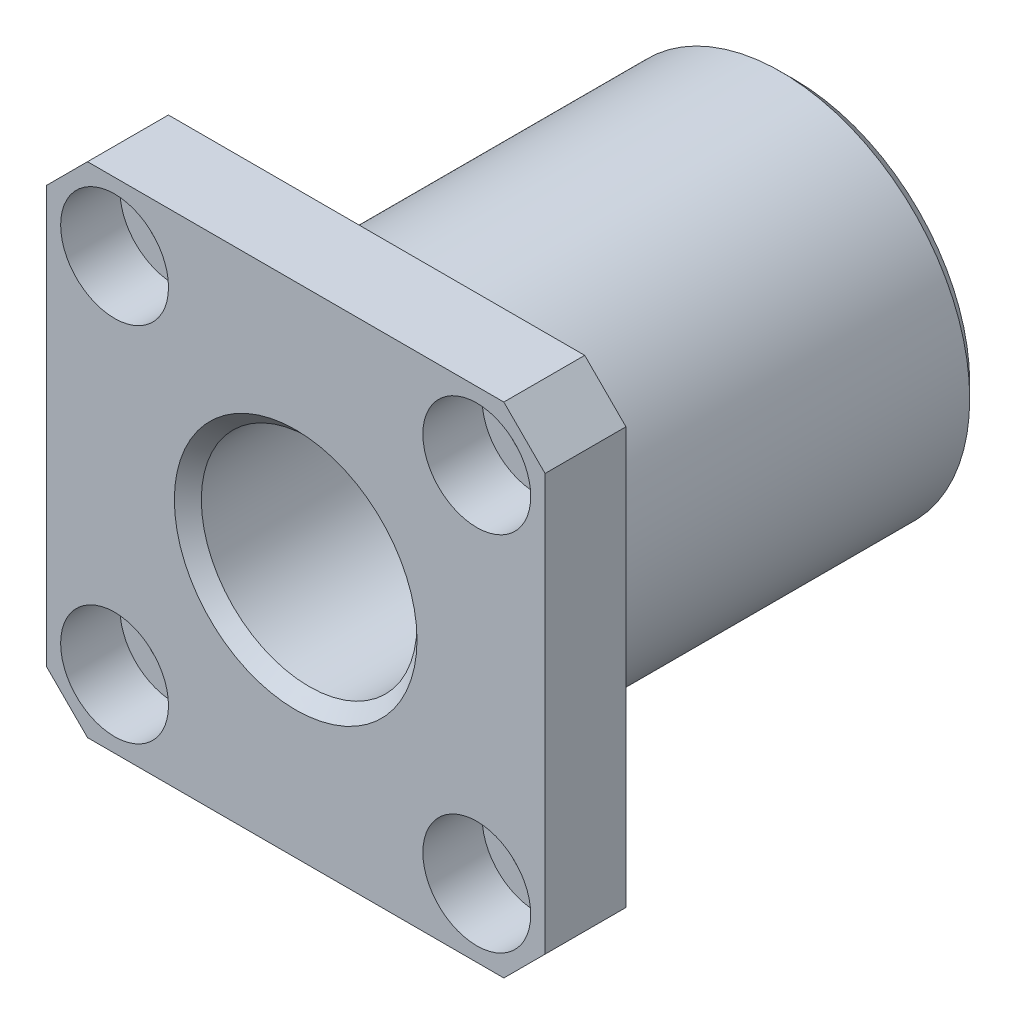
ISO-10303-21;
HEADER;
FILE_DESCRIPTION(('STEP AP214'),'2;1');
FILE_NAME('part.step','',(''),(''),'','','');
FILE_SCHEMA(('AUTOMOTIVE_DESIGN { 1 0 10303 214 1 1 1 1 }'));
ENDSEC;
DATA;
#1=APPLICATION_CONTEXT('core data for automotive mechanical design processes');
#2=APPLICATION_PROTOCOL_DEFINITION('international standard','automotive_design',2000,#1);
#3=PRODUCT_CONTEXT('',#1,'mechanical');
#4=PRODUCT('Part','Part','',(#3));
#5=PRODUCT_RELATED_PRODUCT_CATEGORY('part','',(#4));
#6=PRODUCT_DEFINITION_FORMATION('','',#4);
#7=PRODUCT_DEFINITION_CONTEXT('part definition',#1,'design');
#8=PRODUCT_DEFINITION('design','',#6,#7);
#9=PRODUCT_DEFINITION_SHAPE('','',#8);
#10=(LENGTH_UNIT() NAMED_UNIT(*) SI_UNIT(.MILLI.,.METRE.));
#11=(NAMED_UNIT(*) PLANE_ANGLE_UNIT() SI_UNIT($,.RADIAN.));
#12=(NAMED_UNIT(*) SI_UNIT($,.STERADIAN.) SOLID_ANGLE_UNIT());
#13=UNCERTAINTY_MEASURE_WITH_UNIT(LENGTH_MEASURE(1.E-05),#10,'distance_accuracy_value','');
#14=(GEOMETRIC_REPRESENTATION_CONTEXT(3) GLOBAL_UNCERTAINTY_ASSIGNED_CONTEXT((#13)) GLOBAL_UNIT_ASSIGNED_CONTEXT((#10,
#11,#12)) REPRESENTATION_CONTEXT('',''));
#15=CARTESIAN_POINT('',(0.,0.,0.));
#16=DIRECTION('',(0.,0.,1.));
#17=DIRECTION('',(1.,0.,0.));
#18=AXIS2_PLACEMENT_3D('',#15,#16,#17);
#19=CARTESIAN_POINT('',(0.,0.,36.));
#20=DIRECTION('',(0.,0.,1.));
#21=DIRECTION('',(1.,0.,0.));
#22=AXIS2_PLACEMENT_3D('',#19,#20,#21);
#23=CONICAL_SURFACE('',#22,8.,0.785398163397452);
#24=CARTESIAN_POINT('',(0.,0.,36.));
#25=DIRECTION('',(0.,0.,1.));
#26=DIRECTION('',(1.,0.,0.));
#27=AXIS2_PLACEMENT_3D('',#24,#25,#26);
#28=CIRCLE('',#27,8.);
#29=CARTESIAN_POINT('',(8.,0.,36.));
#30=VERTEX_POINT('',#29);
#31=CARTESIAN_POINT('',(-8.,0.,36.));
#32=VERTEX_POINT('',#31);
#33=EDGE_CURVE('E37',#30,#32,#28,.T.);
#34=ORIENTED_EDGE('',*,*,#33,.F.);
#35=CARTESIAN_POINT('',(0.,0.,36.));
#36=DIRECTION('',(0.,0.,1.));
#37=DIRECTION('',(1.,0.,0.));
#38=AXIS2_PLACEMENT_3D('',#35,#36,#37);
#39=CIRCLE('',#38,8.);
#40=EDGE_CURVE('E18',#32,#30,#39,.T.);
#41=ORIENTED_EDGE('',*,*,#40,.F.);
#42=DIRECTION('',(-0.70710678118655,0.,0.707106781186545));
#43=VECTOR('',#42,1.);
#44=CARTESIAN_POINT('',(-8.,0.,36.));
#45=LINE('',#44,#43);
#46=CARTESIAN_POINT('',(-9.,0.,37.));
#47=VERTEX_POINT('',#46);
#48=EDGE_CURVE('E9',#32,#47,#45,.T.);
#49=ORIENTED_EDGE('',*,*,#48,.T.);
#50=CARTESIAN_POINT('',(0.,0.,37.));
#51=DIRECTION('',(0.,0.,-1.));
#52=DIRECTION('',(1.,0.,0.));
#53=AXIS2_PLACEMENT_3D('',#50,#51,#52);
#54=CIRCLE('',#53,9.);
#55=CARTESIAN_POINT('',(9.,0.,37.));
#56=VERTEX_POINT('',#55);
#57=EDGE_CURVE('E411',#56,#47,#54,.T.);
#58=ORIENTED_EDGE('',*,*,#57,.F.);
#59=CARTESIAN_POINT('',(0.,0.,37.));
#60=DIRECTION('',(0.,0.,-1.));
#61=DIRECTION('',(1.,0.,0.));
#62=AXIS2_PLACEMENT_3D('',#59,#60,#61);
#63=CIRCLE('',#62,9.);
#64=EDGE_CURVE('E367',#47,#56,#63,.T.);
#65=ORIENTED_EDGE('',*,*,#64,.F.);
#66=ORIENTED_EDGE('',*,*,#48,.F.);
#67=EDGE_LOOP('',(#34,#41,#49,#58,#65,#66));
#68=FACE_BOUND('',#67,.T.);
#69=ADVANCED_FACE('F15',(#68),#23,.F.);
#70=CARTESIAN_POINT('',(0.,0.,1.));
#71=DIRECTION('',(0.,0.,1.));
#72=DIRECTION('',(1.,0.,0.));
#73=AXIS2_PLACEMENT_3D('',#70,#71,#72);
#74=CONICAL_SURFACE('',#73,14.,0.78539816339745);
#75=CARTESIAN_POINT('',(0.,0.,1.));
#76=DIRECTION('',(0.,0.,1.));
#77=DIRECTION('',(1.,0.,0.));
#78=AXIS2_PLACEMENT_3D('',#75,#76,#77);
#79=CIRCLE('',#78,14.);
#80=CARTESIAN_POINT('',(-14.,0.,1.));
#81=VERTEX_POINT('',#80);
#82=CARTESIAN_POINT('',(14.,0.,1.));
#83=VERTEX_POINT('',#82);
#84=EDGE_CURVE('E274',#81,#83,#79,.T.);
#85=ORIENTED_EDGE('',*,*,#84,.F.);
#86=DIRECTION('',(0.707106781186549,0.,-0.707106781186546));
#87=VECTOR('',#86,1.);
#88=CARTESIAN_POINT('',(-14.,0.,1.));
#89=LINE('',#88,#87);
#90=CARTESIAN_POINT('',(-13.,0.,0.));
#91=VERTEX_POINT('',#90);
#92=EDGE_CURVE('E24',#81,#91,#89,.T.);
#93=ORIENTED_EDGE('',*,*,#92,.T.);
#94=CARTESIAN_POINT('',(0.,0.,0.));
#95=DIRECTION('',(0.,0.,-1.));
#96=DIRECTION('',(1.,0.,0.));
#97=AXIS2_PLACEMENT_3D('',#94,#95,#96);
#98=CIRCLE('',#97,13.);
#99=CARTESIAN_POINT('',(13.,0.,0.));
#100=VERTEX_POINT('',#99);
#101=EDGE_CURVE('E277',#100,#91,#98,.T.);
#102=ORIENTED_EDGE('',*,*,#101,.F.);
#103=CARTESIAN_POINT('',(0.,0.,0.));
#104=DIRECTION('',(0.,0.,-1.));
#105=DIRECTION('',(1.,0.,0.));
#106=AXIS2_PLACEMENT_3D('',#103,#104,#105);
#107=CIRCLE('',#106,13.);
#108=EDGE_CURVE('E266',#91,#100,#107,.T.);
#109=ORIENTED_EDGE('',*,*,#108,.F.);
#110=ORIENTED_EDGE('',*,*,#92,.F.);
#111=CARTESIAN_POINT('',(0.,0.,1.));
#112=DIRECTION('',(0.,0.,1.));
#113=DIRECTION('',(1.,0.,0.));
#114=AXIS2_PLACEMENT_3D('',#111,#112,#113);
#115=CIRCLE('',#114,14.);
#116=EDGE_CURVE('E263',#83,#81,#115,.T.);
#117=ORIENTED_EDGE('',*,*,#116,.F.);
#118=EDGE_LOOP('',(#85,#93,#102,#109,#110,#117));
#119=FACE_BOUND('',#118,.T.);
#120=ADVANCED_FACE('F262',(#119),#74,.T.);
#121=CARTESIAN_POINT('',(0.,0.,0.));
#122=DIRECTION('',(0.,0.,1.));
#123=DIRECTION('',(1.,0.,0.));
#124=AXIS2_PLACEMENT_3D('',#121,#122,#123);
#125=CYLINDRICAL_SURFACE('',#124,8.);
#126=CARTESIAN_POINT('',(0.,0.,0.));
#127=DIRECTION('',(0.,0.,1.));
#128=DIRECTION('',(1.,0.,0.));
#129=AXIS2_PLACEMENT_3D('',#126,#127,#128);
#130=CIRCLE('',#129,8.);
#131=CARTESIAN_POINT('',(8.,0.,0.));
#132=VERTEX_POINT('',#131);
#133=CARTESIAN_POINT('',(-8.,0.,0.));
#134=VERTEX_POINT('',#133);
#135=EDGE_CURVE('E318',#132,#134,#130,.T.);
#136=ORIENTED_EDGE('',*,*,#135,.F.);
#137=CARTESIAN_POINT('',(0.,0.,0.));
#138=DIRECTION('',(0.,0.,1.));
#139=DIRECTION('',(1.,0.,0.));
#140=AXIS2_PLACEMENT_3D('',#137,#138,#139);
#141=CIRCLE('',#140,8.);
#142=EDGE_CURVE('E332',#134,#132,#141,.T.);
#143=ORIENTED_EDGE('',*,*,#142,.F.);
#144=DIRECTION('',(0.,0.,1.));
#145=VECTOR('',#144,1.);
#146=CARTESIAN_POINT('',(-8.,0.,0.));
#147=LINE('',#146,#145);
#148=EDGE_CURVE('E379',#134,#32,#147,.T.);
#149=ORIENTED_EDGE('',*,*,#148,.T.);
#150=ORIENTED_EDGE('',*,*,#40,.T.);
#151=ORIENTED_EDGE('',*,*,#33,.T.);
#152=ORIENTED_EDGE('',*,*,#148,.F.);
#153=EDGE_LOOP('',(#136,#143,#149,#150,#151,#152));
#154=FACE_BOUND('',#153,.T.);
#155=ADVANCED_FACE('F617',(#154),#125,.F.);
#156=CARTESIAN_POINT('',(-13.4350288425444,13.4350288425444,37.));
#157=DIRECTION('',(0.,0.,1.));
#158=DIRECTION('',(1.,0.,0.));
#159=AXIS2_PLACEMENT_3D('',#156,#157,#158);
#160=CYLINDRICAL_SURFACE('',#159,4.);
#161=CARTESIAN_POINT('',(-13.4350288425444,13.4350288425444,32.6));
#162=DIRECTION('',(0.,0.,1.));
#163=DIRECTION('',(1.,0.,0.));
#164=AXIS2_PLACEMENT_3D('',#161,#162,#163);
#165=CIRCLE('',#164,4.);
#166=CARTESIAN_POINT('',(-9.4350288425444,13.4350288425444,32.6));
#167=VERTEX_POINT('',#166);
#168=CARTESIAN_POINT('',(-17.4350288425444,13.4350288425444,32.6));
#169=VERTEX_POINT('',#168);
#170=EDGE_CURVE('E323',#167,#169,#165,.T.);
#171=ORIENTED_EDGE('',*,*,#170,.F.);
#172=CARTESIAN_POINT('',(-13.4350288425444,13.4350288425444,32.6));
#173=DIRECTION('',(0.,0.,1.));
#174=DIRECTION('',(1.,0.,0.));
#175=AXIS2_PLACEMENT_3D('',#172,#173,#174);
#176=CIRCLE('',#175,4.);
#177=EDGE_CURVE('E319',#169,#167,#176,.T.);
#178=ORIENTED_EDGE('',*,*,#177,.F.);
#179=DIRECTION('',(0.,0.,1.));
#180=VECTOR('',#179,1.);
#181=CARTESIAN_POINT('',(-17.4350288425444,13.4350288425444,37.));
#182=LINE('',#181,#180);
#183=CARTESIAN_POINT('',(-17.4350288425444,13.4350288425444,37.));
#184=VERTEX_POINT('',#183);
#185=EDGE_CURVE('E322',#169,#184,#182,.T.);
#186=ORIENTED_EDGE('',*,*,#185,.T.);
#187=CARTESIAN_POINT('',(-13.4350288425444,13.4350288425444,37.));
#188=DIRECTION('',(0.,0.,1.));
#189=DIRECTION('',(1.,0.,0.));
#190=AXIS2_PLACEMENT_3D('',#187,#188,#189);
#191=CIRCLE('',#190,4.);
#192=CARTESIAN_POINT('',(-9.4350288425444,13.4350288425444,37.));
#193=VERTEX_POINT('',#192);
#194=EDGE_CURVE('E366',#184,#193,#191,.T.);
#195=ORIENTED_EDGE('',*,*,#194,.T.);
#196=CARTESIAN_POINT('',(-13.4350288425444,13.4350288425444,37.));
#197=DIRECTION('',(0.,0.,1.));
#198=DIRECTION('',(1.,0.,0.));
#199=AXIS2_PLACEMENT_3D('',#196,#197,#198);
#200=CIRCLE('',#199,4.);
#201=EDGE_CURVE('E362',#193,#184,#200,.T.);
#202=ORIENTED_EDGE('',*,*,#201,.T.);
#203=ORIENTED_EDGE('',*,*,#185,.F.);
#204=EDGE_LOOP('',(#171,#178,#186,#195,#202,#203));
#205=FACE_BOUND('',#204,.T.);
#206=ADVANCED_FACE('F621',(#205),#160,.F.);
#207=CARTESIAN_POINT('',(-11.1850288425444,13.4350288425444,32.6));
#208=DIRECTION('',(0.,0.,-1.));
#209=DIRECTION('',(0.,-1.,0.));
#210=AXIS2_PLACEMENT_3D('',#207,#208,#209);
#211=PLANE('',#210);
#212=CARTESIAN_POINT('',(-13.4350288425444,13.4350288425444,32.6));
#213=DIRECTION('',(0.,0.,1.));
#214=DIRECTION('',(1.,0.,0.));
#215=AXIS2_PLACEMENT_3D('',#212,#213,#214);
#216=CIRCLE('',#215,2.25);
#217=CARTESIAN_POINT('',(-11.1850288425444,13.4350288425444,32.6));
#218=VERTEX_POINT('',#217);
#219=CARTESIAN_POINT('',(-15.6850288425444,13.4350288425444,32.6));
#220=VERTEX_POINT('',#219);
#221=EDGE_CURVE('E427',#218,#220,#216,.T.);
#222=ORIENTED_EDGE('',*,*,#221,.F.);
#223=CARTESIAN_POINT('',(-13.4350288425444,13.4350288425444,32.6));
#224=DIRECTION('',(0.,0.,1.));
#225=DIRECTION('',(1.,0.,0.));
#226=AXIS2_PLACEMENT_3D('',#223,#224,#225);
#227=CIRCLE('',#226,2.25);
#228=EDGE_CURVE('E491',#220,#218,#227,.T.);
#229=ORIENTED_EDGE('',*,*,#228,.F.);
#230=EDGE_LOOP('',(#222,#229));
#231=FACE_BOUND('',#230,.T.);
#232=ORIENTED_EDGE('',*,*,#170,.T.);
#233=ORIENTED_EDGE('',*,*,#177,.T.);
#234=EDGE_LOOP('',(#232,#233));
#235=FACE_BOUND('',#234,.T.);
#236=ADVANCED_FACE('F532',(#231,#235),#211,.F.);
#237=CARTESIAN_POINT('',(-13.4350288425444,13.4350288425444,37.));
#238=DIRECTION('',(0.,0.,1.));
#239=DIRECTION('',(1.,0.,0.));
#240=AXIS2_PLACEMENT_3D('',#237,#238,#239);
#241=CYLINDRICAL_SURFACE('',#240,2.25);
#242=CARTESIAN_POINT('',(-13.4350288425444,13.4350288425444,31.));
#243=DIRECTION('',(0.,0.,-1.));
#244=DIRECTION('',(-1.,0.,0.));
#245=AXIS2_PLACEMENT_3D('',#242,#243,#244);
#246=CIRCLE('',#245,2.25);
#247=CARTESIAN_POINT('',(-15.6850288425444,13.4350288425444,31.));
#248=VERTEX_POINT('',#247);
#249=EDGE_CURVE('E423',#248,#248,#246,.T.);
#250=ORIENTED_EDGE('',*,*,#249,.T.);
#251=DIRECTION('',(0.,0.,1.));
#252=VECTOR('',#251,1.);
#253=CARTESIAN_POINT('',(-15.6850288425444,13.4350288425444,37.));
#254=LINE('',#253,#252);
#255=EDGE_CURVE('E479',#248,#220,#254,.T.);
#256=ORIENTED_EDGE('',*,*,#255,.T.);
#257=ORIENTED_EDGE('',*,*,#228,.T.);
#258=ORIENTED_EDGE('',*,*,#221,.T.);
#259=ORIENTED_EDGE('',*,*,#255,.F.);
#260=EDGE_LOOP('',(#250,#256,#257,#258,#259));
#261=FACE_BOUND('',#260,.T.);
#262=ADVANCED_FACE('F530',(#261),#241,.F.);
#263=CARTESIAN_POINT('',(13.4350288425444,13.4350288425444,37.));
#264=DIRECTION('',(0.,0.,1.));
#265=DIRECTION('',(1.,0.,0.));
#266=AXIS2_PLACEMENT_3D('',#263,#264,#265);
#267=CYLINDRICAL_SURFACE('',#266,4.);
#268=CARTESIAN_POINT('',(13.4350288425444,13.4350288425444,32.6));
#269=DIRECTION('',(0.,0.,1.));
#270=DIRECTION('',(1.,0.,0.));
#271=AXIS2_PLACEMENT_3D('',#268,#269,#270);
#272=CIRCLE('',#271,4.);
#273=CARTESIAN_POINT('',(17.4350288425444,13.4350288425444,32.6));
#274=VERTEX_POINT('',#273);
#275=CARTESIAN_POINT('',(9.4350288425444,13.4350288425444,32.6));
#276=VERTEX_POINT('',#275);
#277=EDGE_CURVE('E432',#274,#276,#272,.T.);
#278=ORIENTED_EDGE('',*,*,#277,.F.);
#279=CARTESIAN_POINT('',(13.4350288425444,13.4350288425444,32.6));
#280=DIRECTION('',(0.,0.,1.));
#281=DIRECTION('',(1.,0.,0.));
#282=AXIS2_PLACEMENT_3D('',#279,#280,#281);
#283=CIRCLE('',#282,4.);
#284=EDGE_CURVE('E436',#276,#274,#283,.T.);
#285=ORIENTED_EDGE('',*,*,#284,.F.);
#286=DIRECTION('',(0.,0.,1.));
#287=VECTOR('',#286,1.);
#288=CARTESIAN_POINT('',(9.4350288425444,13.4350288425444,37.));
#289=LINE('',#288,#287);
#290=CARTESIAN_POINT('',(9.4350288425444,13.4350288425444,37.));
#291=VERTEX_POINT('',#290);
#292=EDGE_CURVE('E476',#276,#291,#289,.T.);
#293=ORIENTED_EDGE('',*,*,#292,.T.);
#294=CARTESIAN_POINT('',(13.4350288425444,13.4350288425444,37.));
#295=DIRECTION('',(0.,0.,1.));
#296=DIRECTION('',(1.,0.,0.));
#297=AXIS2_PLACEMENT_3D('',#294,#295,#296);
#298=CIRCLE('',#297,4.);
#299=CARTESIAN_POINT('',(17.4350288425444,13.4350288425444,37.));
#300=VERTEX_POINT('',#299);
#301=EDGE_CURVE('E297',#291,#300,#298,.T.);
#302=ORIENTED_EDGE('',*,*,#301,.T.);
#303=CARTESIAN_POINT('',(13.4350288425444,13.4350288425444,37.));
#304=DIRECTION('',(0.,0.,1.));
#305=DIRECTION('',(1.,0.,0.));
#306=AXIS2_PLACEMENT_3D('',#303,#304,#305);
#307=CIRCLE('',#306,4.);
#308=EDGE_CURVE('E472',#300,#291,#307,.T.);
#309=ORIENTED_EDGE('',*,*,#308,.T.);
#310=ORIENTED_EDGE('',*,*,#292,.F.);
#311=EDGE_LOOP('',(#278,#285,#293,#302,#309,#310));
#312=FACE_BOUND('',#311,.T.);
#313=ADVANCED_FACE('F630',(#312),#267,.F.);
#314=CARTESIAN_POINT('',(15.6850288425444,13.4350288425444,32.6));
#315=DIRECTION('',(0.,0.,-1.));
#316=DIRECTION('',(0.,-1.,0.));
#317=AXIS2_PLACEMENT_3D('',#314,#315,#316);
#318=PLANE('',#317);
#319=CARTESIAN_POINT('',(13.4350288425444,13.4350288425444,32.6));
#320=DIRECTION('',(0.,0.,1.));
#321=DIRECTION('',(1.,0.,0.));
#322=AXIS2_PLACEMENT_3D('',#319,#320,#321);
#323=CIRCLE('',#322,2.25);
#324=CARTESIAN_POINT('',(15.6850288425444,13.4350288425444,32.6));
#325=VERTEX_POINT('',#324);
#326=CARTESIAN_POINT('',(11.1850288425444,13.4350288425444,32.6));
#327=VERTEX_POINT('',#326);
#328=EDGE_CURVE('E437',#325,#327,#323,.T.);
#329=ORIENTED_EDGE('',*,*,#328,.F.);
#330=CARTESIAN_POINT('',(13.4350288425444,13.4350288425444,32.6));
#331=DIRECTION('',(0.,0.,1.));
#332=DIRECTION('',(1.,0.,0.));
#333=AXIS2_PLACEMENT_3D('',#330,#331,#332);
#334=CIRCLE('',#333,2.25);
#335=EDGE_CURVE('E447',#327,#325,#334,.T.);
#336=ORIENTED_EDGE('',*,*,#335,.F.);
#337=EDGE_LOOP('',(#329,#336));
#338=FACE_BOUND('',#337,.T.);
#339=ORIENTED_EDGE('',*,*,#277,.T.);
#340=ORIENTED_EDGE('',*,*,#284,.T.);
#341=EDGE_LOOP('',(#339,#340));
#342=FACE_BOUND('',#341,.T.);
#343=ADVANCED_FACE('F633',(#338,#342),#318,.F.);
#344=CARTESIAN_POINT('',(13.4350288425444,13.4350288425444,37.));
#345=DIRECTION('',(0.,0.,1.));
#346=DIRECTION('',(1.,0.,0.));
#347=AXIS2_PLACEMENT_3D('',#344,#345,#346);
#348=CYLINDRICAL_SURFACE('',#347,2.25);
#349=CARTESIAN_POINT('',(13.4350288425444,13.4350288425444,31.));
#350=DIRECTION('',(0.,0.,-1.));
#351=DIRECTION('',(-1.,0.,0.));
#352=AXIS2_PLACEMENT_3D('',#349,#350,#351);
#353=CIRCLE('',#352,2.25);
#354=CARTESIAN_POINT('',(11.1850288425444,13.4350288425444,31.));
#355=VERTEX_POINT('',#354);
#356=EDGE_CURVE('E431',#355,#355,#353,.T.);
#357=ORIENTED_EDGE('',*,*,#356,.T.);
#358=DIRECTION('',(0.,0.,1.));
#359=VECTOR('',#358,1.);
#360=CARTESIAN_POINT('',(11.1850288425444,13.4350288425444,37.));
#361=LINE('',#360,#359);
#362=EDGE_CURVE('E514',#355,#327,#361,.T.);
#363=ORIENTED_EDGE('',*,*,#362,.T.);
#364=ORIENTED_EDGE('',*,*,#335,.T.);
#365=ORIENTED_EDGE('',*,*,#328,.T.);
#366=ORIENTED_EDGE('',*,*,#362,.F.);
#367=EDGE_LOOP('',(#357,#363,#364,#365,#366));
#368=FACE_BOUND('',#367,.T.);
#369=ADVANCED_FACE('F637',(#368),#348,.F.);
#370=CARTESIAN_POINT('',(13.4350288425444,-13.4350288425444,37.));
#371=DIRECTION('',(0.,0.,1.));
#372=DIRECTION('',(1.,0.,0.));
#373=AXIS2_PLACEMENT_3D('',#370,#371,#372);
#374=CYLINDRICAL_SURFACE('',#373,4.);
#375=CARTESIAN_POINT('',(13.4350288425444,-13.4350288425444,32.6));
#376=DIRECTION('',(0.,0.,1.));
#377=DIRECTION('',(1.,0.,0.));
#378=AXIS2_PLACEMENT_3D('',#375,#376,#377);
#379=CIRCLE('',#378,4.);
#380=CARTESIAN_POINT('',(17.4350288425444,-13.4350288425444,32.6));
#381=VERTEX_POINT('',#380);
#382=CARTESIAN_POINT('',(9.4350288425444,-13.4350288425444,32.6));
#383=VERTEX_POINT('',#382);
#384=EDGE_CURVE('E380',#381,#383,#379,.T.);
#385=ORIENTED_EDGE('',*,*,#384,.F.);
#386=CARTESIAN_POINT('',(13.4350288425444,-13.4350288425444,32.6));
#387=DIRECTION('',(0.,0.,1.));
#388=DIRECTION('',(1.,0.,0.));
#389=AXIS2_PLACEMENT_3D('',#386,#387,#388);
#390=CIRCLE('',#389,4.);
#391=EDGE_CURVE('E384',#383,#381,#390,.T.);
#392=ORIENTED_EDGE('',*,*,#391,.F.);
#393=DIRECTION('',(0.,0.,1.));
#394=VECTOR('',#393,1.);
#395=CARTESIAN_POINT('',(9.4350288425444,-13.4350288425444,37.));
#396=LINE('',#395,#394);
#397=CARTESIAN_POINT('',(9.4350288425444,-13.4350288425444,37.));
#398=VERTEX_POINT('',#397);
#399=EDGE_CURVE('E511',#383,#398,#396,.T.);
#400=ORIENTED_EDGE('',*,*,#399,.T.);
#401=CARTESIAN_POINT('',(13.4350288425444,-13.4350288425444,37.));
#402=DIRECTION('',(0.,0.,1.));
#403=DIRECTION('',(1.,0.,0.));
#404=AXIS2_PLACEMENT_3D('',#401,#402,#403);
#405=CIRCLE('',#404,4.);
#406=CARTESIAN_POINT('',(17.4350288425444,-13.4350288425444,37.));
#407=VERTEX_POINT('',#406);
#408=EDGE_CURVE('E296',#398,#407,#405,.T.);
#409=ORIENTED_EDGE('',*,*,#408,.T.);
#410=CARTESIAN_POINT('',(13.4350288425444,-13.4350288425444,37.));
#411=DIRECTION('',(0.,0.,1.));
#412=DIRECTION('',(1.,0.,0.));
#413=AXIS2_PLACEMENT_3D('',#410,#411,#412);
#414=CIRCLE('',#413,4.);
#415=EDGE_CURVE('E292',#407,#398,#414,.T.);
#416=ORIENTED_EDGE('',*,*,#415,.T.);
#417=ORIENTED_EDGE('',*,*,#399,.F.);
#418=EDGE_LOOP('',(#385,#392,#400,#409,#416,#417));
#419=FACE_BOUND('',#418,.T.);
#420=ADVANCED_FACE('F568',(#419),#374,.F.);
#421=CARTESIAN_POINT('',(15.6850288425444,-13.4350288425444,32.6));
#422=DIRECTION('',(0.,0.,-1.));
#423=DIRECTION('',(0.,-1.,0.));
#424=AXIS2_PLACEMENT_3D('',#421,#422,#423);
#425=PLANE('',#424);
#426=CARTESIAN_POINT('',(13.4350288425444,-13.4350288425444,32.6));
#427=DIRECTION('',(0.,0.,1.));
#428=DIRECTION('',(1.,0.,0.));
#429=AXIS2_PLACEMENT_3D('',#426,#427,#428);
#430=CIRCLE('',#429,2.25);
#431=CARTESIAN_POINT('',(15.6850288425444,-13.4350288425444,32.6));
#432=VERTEX_POINT('',#431);
#433=CARTESIAN_POINT('',(11.1850288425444,-13.4350288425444,32.6));
#434=VERTEX_POINT('',#433);
#435=EDGE_CURVE('E385',#432,#434,#430,.T.);
#436=ORIENTED_EDGE('',*,*,#435,.F.);
#437=CARTESIAN_POINT('',(13.4350288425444,-13.4350288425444,32.6));
#438=DIRECTION('',(0.,0.,1.));
#439=DIRECTION('',(1.,0.,0.));
#440=AXIS2_PLACEMENT_3D('',#437,#438,#439);
#441=CIRCLE('',#440,2.25);
#442=EDGE_CURVE('E505',#434,#432,#441,.T.);
#443=ORIENTED_EDGE('',*,*,#442,.F.);
#444=EDGE_LOOP('',(#436,#443));
#445=FACE_BOUND('',#444,.T.);
#446=ORIENTED_EDGE('',*,*,#384,.T.);
#447=ORIENTED_EDGE('',*,*,#391,.T.);
#448=EDGE_LOOP('',(#446,#447));
#449=FACE_BOUND('',#448,.T.);
#450=ADVANCED_FACE('F566',(#445,#449),#425,.F.);
#451=CARTESIAN_POINT('',(13.4350288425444,-13.4350288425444,37.));
#452=DIRECTION('',(0.,0.,1.));
#453=DIRECTION('',(1.,0.,0.));
#454=AXIS2_PLACEMENT_3D('',#451,#452,#453);
#455=CYLINDRICAL_SURFACE('',#454,2.25);
#456=CARTESIAN_POINT('',(13.4350288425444,-13.4350288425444,31.));
#457=DIRECTION('',(0.,0.,-1.));
#458=DIRECTION('',(-1.,0.,0.));
#459=AXIS2_PLACEMENT_3D('',#456,#457,#458);
#460=CIRCLE('',#459,2.25);
#461=CARTESIAN_POINT('',(11.1850288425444,-13.4350288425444,31.));
#462=VERTEX_POINT('',#461);
#463=EDGE_CURVE('E441',#462,#462,#460,.T.);
#464=ORIENTED_EDGE('',*,*,#463,.T.);
#465=DIRECTION('',(0.,0.,1.));
#466=VECTOR('',#465,1.);
#467=CARTESIAN_POINT('',(11.1850288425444,-13.4350288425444,37.));
#468=LINE('',#467,#466);
#469=EDGE_CURVE('E290',#462,#434,#468,.T.);
#470=ORIENTED_EDGE('',*,*,#469,.T.);
#471=ORIENTED_EDGE('',*,*,#442,.T.);
#472=ORIENTED_EDGE('',*,*,#435,.T.);
#473=ORIENTED_EDGE('',*,*,#469,.F.);
#474=EDGE_LOOP('',(#464,#470,#471,#472,#473));
#475=FACE_BOUND('',#474,.T.);
#476=ADVANCED_FACE('F646',(#475),#455,.F.);
#477=CARTESIAN_POINT('',(-13.4350288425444,-13.4350288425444,37.));
#478=DIRECTION('',(0.,0.,1.));
#479=DIRECTION('',(1.,0.,0.));
#480=AXIS2_PLACEMENT_3D('',#477,#478,#479);
#481=CYLINDRICAL_SURFACE('',#480,4.);
#482=CARTESIAN_POINT('',(-13.4350288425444,-13.4350288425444,32.6));
#483=DIRECTION('',(0.,0.,1.));
#484=DIRECTION('',(1.,0.,0.));
#485=AXIS2_PLACEMENT_3D('',#482,#483,#484);
#486=CIRCLE('',#485,4.);
#487=CARTESIAN_POINT('',(-9.4350288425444,-13.4350288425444,32.6));
#488=VERTEX_POINT('',#487);
#489=CARTESIAN_POINT('',(-17.4350288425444,-13.4350288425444,32.6));
#490=VERTEX_POINT('',#489);
#491=EDGE_CURVE('E328',#488,#490,#486,.T.);
#492=ORIENTED_EDGE('',*,*,#491,.F.);
#493=CARTESIAN_POINT('',(-13.4350288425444,-13.4350288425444,32.6));
#494=DIRECTION('',(0.,0.,1.));
#495=DIRECTION('',(1.,0.,0.));
#496=AXIS2_PLACEMENT_3D('',#493,#494,#495);
#497=CIRCLE('',#496,4.);
#498=EDGE_CURVE('E324',#490,#488,#497,.T.);
#499=ORIENTED_EDGE('',*,*,#498,.F.);
#500=DIRECTION('',(0.,0.,1.));
#501=VECTOR('',#500,1.);
#502=CARTESIAN_POINT('',(-17.4350288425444,-13.4350288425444,37.));
#503=LINE('',#502,#501);
#504=CARTESIAN_POINT('',(-17.4350288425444,-13.4350288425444,37.));
#505=VERTEX_POINT('',#504);
#506=EDGE_CURVE('E327',#490,#505,#503,.T.);
#507=ORIENTED_EDGE('',*,*,#506,.T.);
#508=CARTESIAN_POINT('',(-13.4350288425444,-13.4350288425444,37.));
#509=DIRECTION('',(0.,0.,1.));
#510=DIRECTION('',(1.,0.,0.));
#511=AXIS2_PLACEMENT_3D('',#508,#509,#510);
#512=CIRCLE('',#511,4.);
#513=CARTESIAN_POINT('',(-9.4350288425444,-13.4350288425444,37.));
#514=VERTEX_POINT('',#513);
#515=EDGE_CURVE('E488',#505,#514,#512,.T.);
#516=ORIENTED_EDGE('',*,*,#515,.T.);
#517=CARTESIAN_POINT('',(-13.4350288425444,-13.4350288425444,37.));
#518=DIRECTION('',(0.,0.,1.));
#519=DIRECTION('',(1.,0.,0.));
#520=AXIS2_PLACEMENT_3D('',#517,#518,#519);
#521=CIRCLE('',#520,4.);
#522=EDGE_CURVE('E484',#514,#505,#521,.T.);
#523=ORIENTED_EDGE('',*,*,#522,.T.);
#524=ORIENTED_EDGE('',*,*,#506,.F.);
#525=EDGE_LOOP('',(#492,#499,#507,#516,#523,#524));
#526=FACE_BOUND('',#525,.T.);
#527=ADVANCED_FACE('F648',(#526),#481,.F.);
#528=CARTESIAN_POINT('',(-11.1850288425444,-13.4350288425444,32.6));
#529=DIRECTION('',(0.,0.,-1.));
#530=DIRECTION('',(0.,-1.,0.));
#531=AXIS2_PLACEMENT_3D('',#528,#529,#530);
#532=PLANE('',#531);
#533=CARTESIAN_POINT('',(-13.4350288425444,-13.4350288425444,32.6));
#534=DIRECTION('',(0.,0.,1.));
#535=DIRECTION('',(1.,0.,0.));
#536=AXIS2_PLACEMENT_3D('',#533,#534,#535);
#537=CIRCLE('',#536,2.25);
#538=CARTESIAN_POINT('',(-11.1850288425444,-13.4350288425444,32.6));
#539=VERTEX_POINT('',#538);
#540=CARTESIAN_POINT('',(-15.6850288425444,-13.4350288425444,32.6));
#541=VERTEX_POINT('',#540);
#542=EDGE_CURVE('E466',#539,#541,#537,.T.);
#543=ORIENTED_EDGE('',*,*,#542,.F.);
#544=CARTESIAN_POINT('',(-13.4350288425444,-13.4350288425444,32.6));
#545=DIRECTION('',(0.,0.,1.));
#546=DIRECTION('',(1.,0.,0.));
#547=AXIS2_PLACEMENT_3D('',#544,#545,#546);
#548=CIRCLE('',#547,2.25);
#549=EDGE_CURVE('E462',#541,#539,#548,.T.);
#550=ORIENTED_EDGE('',*,*,#549,.F.);
#551=EDGE_LOOP('',(#543,#550));
#552=FACE_BOUND('',#551,.T.);
#553=ORIENTED_EDGE('',*,*,#491,.T.);
#554=ORIENTED_EDGE('',*,*,#498,.T.);
#555=EDGE_LOOP('',(#553,#554));
#556=FACE_BOUND('',#555,.T.);
#557=ADVANCED_FACE('F651',(#552,#556),#532,.F.);
#558=CARTESIAN_POINT('',(-13.4350288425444,-13.4350288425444,37.));
#559=DIRECTION('',(0.,0.,1.));
#560=DIRECTION('',(1.,0.,0.));
#561=AXIS2_PLACEMENT_3D('',#558,#559,#560);
#562=CYLINDRICAL_SURFACE('',#561,2.25);
#563=CARTESIAN_POINT('',(-13.4350288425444,-13.4350288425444,31.));
#564=DIRECTION('',(0.,0.,-1.));
#565=DIRECTION('',(-1.,0.,0.));
#566=AXIS2_PLACEMENT_3D('',#563,#564,#565);
#567=CIRCLE('',#566,2.25);
#568=CARTESIAN_POINT('',(-15.6850288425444,-13.4350288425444,31.));
#569=VERTEX_POINT('',#568);
#570=EDGE_CURVE('E451',#569,#569,#567,.T.);
#571=ORIENTED_EDGE('',*,*,#570,.T.);
#572=DIRECTION('',(0.,0.,1.));
#573=VECTOR('',#572,1.);
#574=CARTESIAN_POINT('',(-15.6850288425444,-13.4350288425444,37.));
#575=LINE('',#574,#573);
#576=EDGE_CURVE('E467',#569,#541,#575,.T.);
#577=ORIENTED_EDGE('',*,*,#576,.T.);
#578=ORIENTED_EDGE('',*,*,#549,.T.);
#579=ORIENTED_EDGE('',*,*,#542,.T.);
#580=ORIENTED_EDGE('',*,*,#576,.F.);
#581=EDGE_LOOP('',(#571,#577,#578,#579,#580));
#582=FACE_BOUND('',#581,.T.);
#583=ADVANCED_FACE('F653',(#582),#562,.F.);
#584=CARTESIAN_POINT('',(-18.5,-15.4411254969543,0.));
#585=DIRECTION('',(0.707106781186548,0.707106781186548,0.));
#586=DIRECTION('',(0.,0.,-1.));
#587=AXIS2_PLACEMENT_3D('',#584,#585,#586);
#588=PLANE('',#587);
#589=DIRECTION('',(0.707106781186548,-0.707106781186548,0.));
#590=VECTOR('',#589,1.);
#591=CARTESIAN_POINT('',(-18.5,-15.4411254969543,31.));
#592=LINE('',#591,#590);
#593=CARTESIAN_POINT('',(-18.5,-15.4411254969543,31.));
#594=VERTEX_POINT('',#593);
#595=CARTESIAN_POINT('',(-15.4411254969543,-18.5,31.));
#596=VERTEX_POINT('',#595);
#597=EDGE_CURVE('E407',#594,#596,#592,.T.);
#598=ORIENTED_EDGE('',*,*,#597,.T.);
#599=DIRECTION('',(0.,0.,1.));
#600=VECTOR('',#599,1.);
#601=CARTESIAN_POINT('',(-15.4411254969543,-18.5,31.));
#602=LINE('',#601,#600);
#603=CARTESIAN_POINT('',(-15.4411254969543,-18.5,37.));
#604=VERTEX_POINT('',#603);
#605=EDGE_CURVE('E345',#596,#604,#602,.T.);
#606=ORIENTED_EDGE('',*,*,#605,.T.);
#607=DIRECTION('',(-0.707106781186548,0.707106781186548,0.));
#608=VECTOR('',#607,1.);
#609=CARTESIAN_POINT('',(-15.4411254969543,-18.5,37.));
#610=LINE('',#609,#608);
#611=CARTESIAN_POINT('',(-18.5,-15.4411254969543,37.));
#612=VERTEX_POINT('',#611);
#613=EDGE_CURVE('E311',#604,#612,#610,.T.);
#614=ORIENTED_EDGE('',*,*,#613,.T.);
#615=DIRECTION('',(0.,0.,1.));
#616=VECTOR('',#615,1.);
#617=CARTESIAN_POINT('',(-18.5,-15.4411254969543,31.));
#618=LINE('',#617,#616);
#619=EDGE_CURVE('E361',#594,#612,#618,.T.);
#620=ORIENTED_EDGE('',*,*,#619,.F.);
#621=EDGE_LOOP('',(#598,#606,#614,#620));
#622=FACE_BOUND('',#621,.T.);
#623=ADVANCED_FACE('F555',(#622),#588,.F.);
#624=CARTESIAN_POINT('',(18.5,-15.4411254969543,0.));
#625=DIRECTION('',(-0.707106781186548,0.707106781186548,0.));
#626=DIRECTION('',(0.,0.,1.));
#627=AXIS2_PLACEMENT_3D('',#624,#625,#626);
#628=PLANE('',#627);
#629=DIRECTION('',(0.707106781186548,0.707106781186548,0.));
#630=VECTOR('',#629,1.);
#631=CARTESIAN_POINT('',(15.4411254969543,-18.5,31.));
#632=LINE('',#631,#630);
#633=CARTESIAN_POINT('',(15.4411254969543,-18.5,31.));
#634=VERTEX_POINT('',#633);
#635=CARTESIAN_POINT('',(18.5,-15.4411254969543,31.));
#636=VERTEX_POINT('',#635);
#637=EDGE_CURVE('E420',#634,#636,#632,.T.);
#638=ORIENTED_EDGE('',*,*,#637,.T.);
#639=DIRECTION('',(0.,0.,1.));
#640=VECTOR('',#639,1.);
#641=CARTESIAN_POINT('',(18.5,-15.4411254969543,31.));
#642=LINE('',#641,#640);
#643=CARTESIAN_POINT('',(18.5,-15.4411254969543,37.));
#644=VERTEX_POINT('',#643);
#645=EDGE_CURVE('E335',#636,#644,#642,.T.);
#646=ORIENTED_EDGE('',*,*,#645,.T.);
#647=DIRECTION('',(-0.707106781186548,-0.707106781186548,0.));
#648=VECTOR('',#647,1.);
#649=CARTESIAN_POINT('',(18.5,-15.4411254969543,37.));
#650=LINE('',#649,#648);
#651=CARTESIAN_POINT('',(15.4411254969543,-18.5,37.));
#652=VERTEX_POINT('',#651);
#653=EDGE_CURVE('E307',#644,#652,#650,.T.);
#654=ORIENTED_EDGE('',*,*,#653,.T.);
#655=DIRECTION('',(0.,0.,1.));
#656=VECTOR('',#655,1.);
#657=CARTESIAN_POINT('',(15.4411254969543,-18.5,31.));
#658=LINE('',#657,#656);
#659=EDGE_CURVE('E346',#634,#652,#658,.T.);
#660=ORIENTED_EDGE('',*,*,#659,.F.);
#661=EDGE_LOOP('',(#638,#646,#654,#660));
#662=FACE_BOUND('',#661,.T.);
#663=ADVANCED_FACE('F590',(#662),#628,.F.);
#664=CARTESIAN_POINT('',(18.5,15.4411254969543,0.));
#665=DIRECTION('',(-0.707106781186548,-0.707106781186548,0.));
#666=DIRECTION('',(-0.707106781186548,0.707106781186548,0.));
#667=AXIS2_PLACEMENT_3D('',#664,#665,#666);
#668=PLANE('',#667);
#669=DIRECTION('',(-0.707106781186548,0.707106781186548,0.));
#670=VECTOR('',#669,1.);
#671=CARTESIAN_POINT('',(18.5,15.4411254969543,31.));
#672=LINE('',#671,#670);
#673=CARTESIAN_POINT('',(18.5,15.4411254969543,31.));
#674=VERTEX_POINT('',#673);
#675=CARTESIAN_POINT('',(15.4411254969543,18.5,31.));
#676=VERTEX_POINT('',#675);
#677=EDGE_CURVE('E417',#674,#676,#672,.T.);
#678=ORIENTED_EDGE('',*,*,#677,.T.);
#679=DIRECTION('',(0.,0.,1.));
#680=VECTOR('',#679,1.);
#681=CARTESIAN_POINT('',(15.4411254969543,18.5,31.));
#682=LINE('',#681,#680);
#683=CARTESIAN_POINT('',(15.4411254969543,18.5,37.));
#684=VERTEX_POINT('',#683);
#685=EDGE_CURVE('E389',#676,#684,#682,.T.);
#686=ORIENTED_EDGE('',*,*,#685,.T.);
#687=DIRECTION('',(0.707106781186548,-0.707106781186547,0.));
#688=VECTOR('',#687,1.);
#689=CARTESIAN_POINT('',(15.4411254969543,18.5,37.));
#690=LINE('',#689,#688);
#691=CARTESIAN_POINT('',(18.5,15.4411254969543,37.));
#692=VERTEX_POINT('',#691);
#693=EDGE_CURVE('E310',#684,#692,#690,.T.);
#694=ORIENTED_EDGE('',*,*,#693,.T.);
#695=DIRECTION('',(0.,0.,1.));
#696=VECTOR('',#695,1.);
#697=CARTESIAN_POINT('',(18.5,15.4411254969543,31.));
#698=LINE('',#697,#696);
#699=EDGE_CURVE('E298',#674,#692,#698,.T.);
#700=ORIENTED_EDGE('',*,*,#699,.F.);
#701=EDGE_LOOP('',(#678,#686,#694,#700));
#702=FACE_BOUND('',#701,.T.);
#703=ADVANCED_FACE('F598',(#702),#668,.F.);
#704=CARTESIAN_POINT('',(-18.5,15.4411254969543,0.));
#705=DIRECTION('',(0.707106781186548,-0.707106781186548,0.));
#706=DIRECTION('',(0.,0.,-1.));
#707=AXIS2_PLACEMENT_3D('',#704,#705,#706);
#708=PLANE('',#707);
#709=DIRECTION('',(-0.707106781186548,-0.707106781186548,0.));
#710=VECTOR('',#709,1.);
#711=CARTESIAN_POINT('',(-15.4411254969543,18.5,31.));
#712=LINE('',#711,#710);
#713=CARTESIAN_POINT('',(-15.4411254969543,18.5,31.));
#714=VERTEX_POINT('',#713);
#715=CARTESIAN_POINT('',(-18.5,15.4411254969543,31.));
#716=VERTEX_POINT('',#715);
#717=EDGE_CURVE('E414',#714,#716,#712,.T.);
#718=ORIENTED_EDGE('',*,*,#717,.T.);
#719=DIRECTION('',(0.,0.,1.));
#720=VECTOR('',#719,1.);
#721=CARTESIAN_POINT('',(-18.5,15.4411254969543,31.));
#722=LINE('',#721,#720);
#723=CARTESIAN_POINT('',(-18.5,15.4411254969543,37.));
#724=VERTEX_POINT('',#723);
#725=EDGE_CURVE('E372',#716,#724,#722,.T.);
#726=ORIENTED_EDGE('',*,*,#725,.T.);
#727=DIRECTION('',(0.707106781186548,0.707106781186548,0.));
#728=VECTOR('',#727,1.);
#729=CARTESIAN_POINT('',(-18.5,15.4411254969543,37.));
#730=LINE('',#729,#728);
#731=CARTESIAN_POINT('',(-15.4411254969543,18.5,37.));
#732=VERTEX_POINT('',#731);
#733=EDGE_CURVE('E408',#724,#732,#730,.T.);
#734=ORIENTED_EDGE('',*,*,#733,.T.);
#735=DIRECTION('',(0.,0.,1.));
#736=VECTOR('',#735,1.);
#737=CARTESIAN_POINT('',(-15.4411254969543,18.5,31.));
#738=LINE('',#737,#736);
#739=EDGE_CURVE('E397',#714,#732,#738,.T.);
#740=ORIENTED_EDGE('',*,*,#739,.F.);
#741=EDGE_LOOP('',(#718,#726,#734,#740));
#742=FACE_BOUND('',#741,.T.);
#743=ADVANCED_FACE('F574',(#742),#708,.F.);
#744=CARTESIAN_POINT('',(0.,0.,37.));
#745=DIRECTION('',(0.,0.,1.));
#746=DIRECTION('',(1.,0.,0.));
#747=AXIS2_PLACEMENT_3D('',#744,#745,#746);
#748=PLANE('',#747);
#749=ORIENTED_EDGE('',*,*,#522,.F.);
#750=ORIENTED_EDGE('',*,*,#515,.F.);
#751=EDGE_LOOP('',(#749,#750));
#752=FACE_BOUND('',#751,.T.);
#753=ORIENTED_EDGE('',*,*,#415,.F.);
#754=ORIENTED_EDGE('',*,*,#408,.F.);
#755=EDGE_LOOP('',(#753,#754));
#756=FACE_BOUND('',#755,.T.);
#757=ORIENTED_EDGE('',*,*,#308,.F.);
#758=ORIENTED_EDGE('',*,*,#301,.F.);
#759=EDGE_LOOP('',(#757,#758));
#760=FACE_BOUND('',#759,.T.);
#761=ORIENTED_EDGE('',*,*,#201,.F.);
#762=ORIENTED_EDGE('',*,*,#194,.F.);
#763=EDGE_LOOP('',(#761,#762));
#764=FACE_BOUND('',#763,.T.);
#765=ORIENTED_EDGE('',*,*,#57,.T.);
#766=ORIENTED_EDGE('',*,*,#64,.T.);
#767=EDGE_LOOP('',(#765,#766));
#768=FACE_BOUND('',#767,.T.);
#769=ORIENTED_EDGE('',*,*,#613,.F.);
#770=DIRECTION('',(1.,0.,0.));
#771=VECTOR('',#770,1.);
#772=CARTESIAN_POINT('',(-15.4411254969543,-18.5,37.));
#773=LINE('',#772,#771);
#774=EDGE_CURVE('E349',#604,#652,#773,.T.);
#775=ORIENTED_EDGE('',*,*,#774,.T.);
#776=ORIENTED_EDGE('',*,*,#653,.F.);
#777=DIRECTION('',(0.,1.,0.));
#778=VECTOR('',#777,1.);
#779=CARTESIAN_POINT('',(18.5,-15.4411254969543,37.));
#780=LINE('',#779,#778);
#781=EDGE_CURVE('E301',#644,#692,#780,.T.);
#782=ORIENTED_EDGE('',*,*,#781,.T.);
#783=ORIENTED_EDGE('',*,*,#693,.F.);
#784=DIRECTION('',(-1.,0.,0.));
#785=VECTOR('',#784,1.);
#786=CARTESIAN_POINT('',(15.4411254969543,18.5,37.));
#787=LINE('',#786,#785);
#788=EDGE_CURVE('E401',#684,#732,#787,.T.);
#789=ORIENTED_EDGE('',*,*,#788,.T.);
#790=ORIENTED_EDGE('',*,*,#733,.F.);
#791=DIRECTION('',(0.,-1.,0.));
#792=VECTOR('',#791,1.);
#793=CARTESIAN_POINT('',(-18.5,15.4411254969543,37.));
#794=LINE('',#793,#792);
#795=EDGE_CURVE('E368',#724,#612,#794,.T.);
#796=ORIENTED_EDGE('',*,*,#795,.T.);
#797=EDGE_LOOP('',(#769,#775,#776,#782,#783,#789,#790,#796));
#798=FACE_BOUND('',#797,.T.);
#799=ADVANCED_FACE('F540',(#752,#756,#760,#764,#768,#798),#748,.T.);
#800=CARTESIAN_POINT('',(0.,0.,31.));
#801=DIRECTION('',(0.,0.,-1.));
#802=DIRECTION('',(0.,-1.,0.));
#803=AXIS2_PLACEMENT_3D('',#800,#801,#802);
#804=PLANE('',#803);
#805=ORIENTED_EDGE('',*,*,#570,.F.);
#806=EDGE_LOOP('',(#805));
#807=FACE_BOUND('',#806,.T.);
#808=ORIENTED_EDGE('',*,*,#463,.F.);
#809=EDGE_LOOP('',(#808));
#810=FACE_BOUND('',#809,.T.);
#811=ORIENTED_EDGE('',*,*,#356,.F.);
#812=EDGE_LOOP('',(#811));
#813=FACE_BOUND('',#812,.T.);
#814=ORIENTED_EDGE('',*,*,#249,.F.);
#815=EDGE_LOOP('',(#814));
#816=FACE_BOUND('',#815,.T.);
#817=CARTESIAN_POINT('',(0.,0.,31.));
#818=DIRECTION('',(0.,0.,-1.));
#819=DIRECTION('',(-1.,0.,0.));
#820=AXIS2_PLACEMENT_3D('',#817,#818,#819);
#821=CIRCLE('',#820,14.);
#822=CARTESIAN_POINT('',(-14.,0.,31.));
#823=VERTEX_POINT('',#822);
#824=CARTESIAN_POINT('',(14.,0.,31.));
#825=VERTEX_POINT('',#824);
#826=EDGE_CURVE('E278',#823,#825,#821,.T.);
#827=ORIENTED_EDGE('',*,*,#826,.F.);
#828=CARTESIAN_POINT('',(0.,0.,31.));
#829=DIRECTION('',(0.,0.,-1.));
#830=DIRECTION('',(-1.,0.,0.));
#831=AXIS2_PLACEMENT_3D('',#828,#829,#830);
#832=CIRCLE('',#831,14.);
#833=EDGE_CURVE('E286',#825,#823,#832,.T.);
#834=ORIENTED_EDGE('',*,*,#833,.F.);
#835=EDGE_LOOP('',(#827,#834));
#836=FACE_BOUND('',#835,.T.);
#837=ORIENTED_EDGE('',*,*,#597,.F.);
#838=DIRECTION('',(0.,-1.,0.));
#839=VECTOR('',#838,1.);
#840=CARTESIAN_POINT('',(-18.5,15.4411254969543,31.));
#841=LINE('',#840,#839);
#842=EDGE_CURVE('E376',#716,#594,#841,.T.);
#843=ORIENTED_EDGE('',*,*,#842,.F.);
#844=ORIENTED_EDGE('',*,*,#717,.F.);
#845=DIRECTION('',(-1.,0.,0.));
#846=VECTOR('',#845,1.);
#847=CARTESIAN_POINT('',(15.4411254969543,18.5,31.));
#848=LINE('',#847,#846);
#849=EDGE_CURVE('E393',#676,#714,#848,.T.);
#850=ORIENTED_EDGE('',*,*,#849,.F.);
#851=ORIENTED_EDGE('',*,*,#677,.F.);
#852=DIRECTION('',(0.,1.,0.));
#853=VECTOR('',#852,1.);
#854=CARTESIAN_POINT('',(18.5,-15.4411254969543,31.));
#855=LINE('',#854,#853);
#856=EDGE_CURVE('E302',#636,#674,#855,.T.);
#857=ORIENTED_EDGE('',*,*,#856,.F.);
#858=ORIENTED_EDGE('',*,*,#637,.F.);
#859=DIRECTION('',(1.,0.,0.));
#860=VECTOR('',#859,1.);
#861=CARTESIAN_POINT('',(-15.4411254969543,-18.5,31.));
#862=LINE('',#861,#860);
#863=EDGE_CURVE('E350',#596,#634,#862,.T.);
#864=ORIENTED_EDGE('',*,*,#863,.F.);
#865=EDGE_LOOP('',(#837,#843,#844,#850,#851,#857,#858,#864));
#866=FACE_BOUND('',#865,.T.);
#867=ADVANCED_FACE('F536',(#807,#810,#813,#816,#836,#866),#804,.T.);
#868=CARTESIAN_POINT('',(-18.5,18.5,31.));
#869=DIRECTION('',(0.,1.,0.));
#870=DIRECTION('',(1.,0.,0.));
#871=AXIS2_PLACEMENT_3D('',#868,#869,#870);
#872=PLANE('',#871);
#873=ORIENTED_EDGE('',*,*,#685,.F.);
#874=ORIENTED_EDGE('',*,*,#849,.T.);
#875=ORIENTED_EDGE('',*,*,#739,.T.);
#876=ORIENTED_EDGE('',*,*,#788,.F.);
#877=EDGE_LOOP('',(#873,#874,#875,#876));
#878=FACE_BOUND('',#877,.T.);
#879=ADVANCED_FACE('F539',(#878),#872,.T.);
#880=CARTESIAN_POINT('',(-18.5,-18.5,31.));
#881=DIRECTION('',(-1.,0.,0.));
#882=DIRECTION('',(0.,0.,1.));
#883=AXIS2_PLACEMENT_3D('',#880,#881,#882);
#884=PLANE('',#883);
#885=ORIENTED_EDGE('',*,*,#619,.T.);
#886=ORIENTED_EDGE('',*,*,#795,.F.);
#887=ORIENTED_EDGE('',*,*,#725,.F.);
#888=ORIENTED_EDGE('',*,*,#842,.T.);
#889=EDGE_LOOP('',(#885,#886,#887,#888));
#890=FACE_BOUND('',#889,.T.);
#891=ADVANCED_FACE('F553',(#890),#884,.T.);
#892=CARTESIAN_POINT('',(-18.5,-18.5,31.));
#893=DIRECTION('',(0.,-1.,0.));
#894=DIRECTION('',(0.,0.,-1.));
#895=AXIS2_PLACEMENT_3D('',#892,#893,#894);
#896=PLANE('',#895);
#897=ORIENTED_EDGE('',*,*,#605,.F.);
#898=ORIENTED_EDGE('',*,*,#863,.T.);
#899=ORIENTED_EDGE('',*,*,#659,.T.);
#900=ORIENTED_EDGE('',*,*,#774,.F.);
#901=EDGE_LOOP('',(#897,#898,#899,#900));
#902=FACE_BOUND('',#901,.T.);
#903=ADVANCED_FACE('F587',(#902),#896,.T.);
#904=CARTESIAN_POINT('',(18.5,-18.5,31.));
#905=DIRECTION('',(1.,0.,0.));
#906=DIRECTION('',(0.,1.,0.));
#907=AXIS2_PLACEMENT_3D('',#904,#905,#906);
#908=PLANE('',#907);
#909=ORIENTED_EDGE('',*,*,#645,.F.);
#910=ORIENTED_EDGE('',*,*,#856,.T.);
#911=ORIENTED_EDGE('',*,*,#699,.T.);
#912=ORIENTED_EDGE('',*,*,#781,.F.);
#913=EDGE_LOOP('',(#909,#910,#911,#912));
#914=FACE_BOUND('',#913,.T.);
#915=ADVANCED_FACE('F595',(#914),#908,.T.);
#916=CARTESIAN_POINT('',(0.,0.,0.));
#917=DIRECTION('',(0.,0.,1.));
#918=DIRECTION('',(1.,0.,0.));
#919=AXIS2_PLACEMENT_3D('',#916,#917,#918);
#920=PLANE('',#919);
#921=ORIENTED_EDGE('',*,*,#135,.T.);
#922=ORIENTED_EDGE('',*,*,#142,.T.);
#923=EDGE_LOOP('',(#921,#922));
#924=FACE_BOUND('',#923,.T.);
#925=ORIENTED_EDGE('',*,*,#101,.T.);
#926=ORIENTED_EDGE('',*,*,#108,.T.);
#927=EDGE_LOOP('',(#925,#926));
#928=FACE_BOUND('',#927,.T.);
#929=ADVANCED_FACE('F669',(#924,#928),#920,.F.);
#930=CARTESIAN_POINT('',(0.,0.,37.));
#931=DIRECTION('',(0.,0.,-1.));
#932=DIRECTION('',(-1.,0.,0.));
#933=AXIS2_PLACEMENT_3D('',#930,#931,#932);
#934=CYLINDRICAL_SURFACE('',#933,14.);
#935=ORIENTED_EDGE('',*,*,#84,.T.);
#936=DIRECTION('',(0.,0.,1.));
#937=VECTOR('',#936,1.);
#938=CARTESIAN_POINT('',(14.,0.,37.));
#939=LINE('',#938,#937);
#940=EDGE_CURVE('E275',#83,#825,#939,.T.);
#941=ORIENTED_EDGE('',*,*,#940,.T.);
#942=ORIENTED_EDGE('',*,*,#833,.T.);
#943=ORIENTED_EDGE('',*,*,#826,.T.);
#944=ORIENTED_EDGE('',*,*,#940,.F.);
#945=ORIENTED_EDGE('',*,*,#116,.T.);
#946=EDGE_LOOP('',(#935,#941,#942,#943,#944,#945));
#947=FACE_BOUND('',#946,.T.);
#948=ADVANCED_FACE('F272',(#947),#934,.T.);
#949=CLOSED_SHELL('',(#69,#120,#155,#206,#236,#262,#313,#343,#369,#420,#450,#476,#527,#557,#583,
#623,#663,#703,#743,#799,#867,#879,#891,#903,#915,#929,#948));
#950=MANIFOLD_SOLID_BREP('B1',#949);
#951=ADVANCED_BREP_SHAPE_REPRESENTATION('',(#18,#950),#14);
#952=SHAPE_DEFINITION_REPRESENTATION(#9,#951);
ENDSEC;
END-ISO-10303-21;
